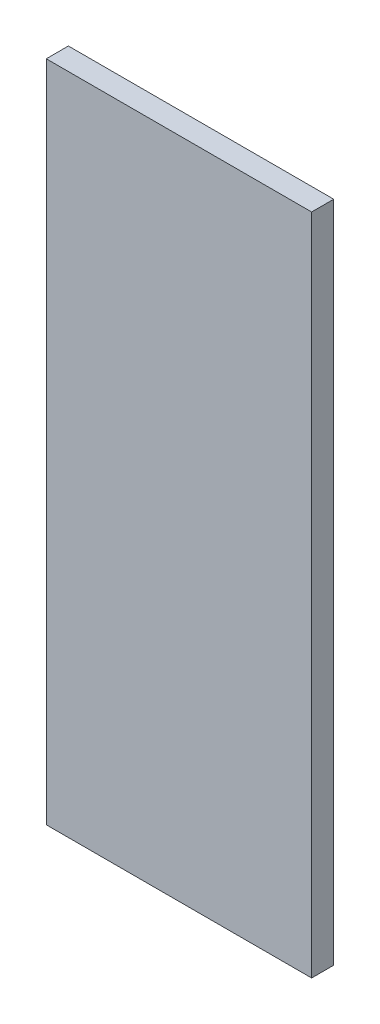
ISO-10303-21;
HEADER;
FILE_DESCRIPTION(('STEP AP214'),'2;1');
FILE_NAME('part.step','',(''),(''),'','','');
FILE_SCHEMA(('AUTOMOTIVE_DESIGN { 1 0 10303 214 1 1 1 1 }'));
ENDSEC;
DATA;
#1=APPLICATION_CONTEXT('core data for automotive mechanical design processes');
#2=APPLICATION_PROTOCOL_DEFINITION('international standard','automotive_design',2000,#1);
#3=PRODUCT_CONTEXT('',#1,'mechanical');
#4=PRODUCT('Part','Part','',(#3));
#5=PRODUCT_RELATED_PRODUCT_CATEGORY('part','',(#4));
#6=PRODUCT_DEFINITION_FORMATION('','',#4);
#7=PRODUCT_DEFINITION_CONTEXT('part definition',#1,'design');
#8=PRODUCT_DEFINITION('design','',#6,#7);
#9=PRODUCT_DEFINITION_SHAPE('','',#8);
#10=(LENGTH_UNIT() NAMED_UNIT(*) SI_UNIT(.MILLI.,.METRE.));
#11=(NAMED_UNIT(*) PLANE_ANGLE_UNIT() SI_UNIT($,.RADIAN.));
#12=(NAMED_UNIT(*) SI_UNIT($,.STERADIAN.) SOLID_ANGLE_UNIT());
#13=UNCERTAINTY_MEASURE_WITH_UNIT(LENGTH_MEASURE(1.E-05),#10,'distance_accuracy_value','');
#14=(GEOMETRIC_REPRESENTATION_CONTEXT(3) GLOBAL_UNCERTAINTY_ASSIGNED_CONTEXT((#13)) GLOBAL_UNIT_ASSIGNED_CONTEXT((#10,
#11,#12)) REPRESENTATION_CONTEXT('',''));
#15=CARTESIAN_POINT('',(0.,0.,0.));
#16=DIRECTION('',(0.,0.,1.));
#17=DIRECTION('',(1.,0.,0.));
#18=AXIS2_PLACEMENT_3D('',#15,#16,#17);
#19=CARTESIAN_POINT('',(-6.,15.,1.));
#20=DIRECTION('',(1.,0.,0.));
#21=DIRECTION('',(0.,1.,0.));
#22=AXIS2_PLACEMENT_3D('',#19,#20,#21);
#23=PLANE('',#22);
#24=DIRECTION('',(0.,-1.,0.));
#25=VECTOR('',#24,1.);
#26=CARTESIAN_POINT('',(-6.,15.,0.));
#27=LINE('',#26,#25);
#28=CARTESIAN_POINT('',(-6.,15.,0.));
#29=VERTEX_POINT('',#28);
#30=CARTESIAN_POINT('',(-6.,-15.,0.));
#31=VERTEX_POINT('',#30);
#32=EDGE_CURVE('E96',#29,#31,#27,.T.);
#33=ORIENTED_EDGE('',*,*,#32,.T.);
#34=DIRECTION('',(0.,0.,-1.));
#35=VECTOR('',#34,1.);
#36=CARTESIAN_POINT('',(-6.,-15.,1.));
#37=LINE('',#36,#35);
#38=CARTESIAN_POINT('',(-6.,-15.,1.));
#39=VERTEX_POINT('',#38);
#40=EDGE_CURVE('E11',#39,#31,#37,.T.);
#41=ORIENTED_EDGE('',*,*,#40,.F.);
#42=DIRECTION('',(0.,-1.,0.));
#43=VECTOR('',#42,1.);
#44=CARTESIAN_POINT('',(-6.,15.,1.));
#45=LINE('',#44,#43);
#46=CARTESIAN_POINT('',(-6.,15.,1.));
#47=VERTEX_POINT('',#46);
#48=EDGE_CURVE('E84',#47,#39,#45,.T.);
#49=ORIENTED_EDGE('',*,*,#48,.F.);
#50=DIRECTION('',(0.,0.,-1.));
#51=VECTOR('',#50,1.);
#52=CARTESIAN_POINT('',(-6.,15.,1.));
#53=LINE('',#52,#51);
#54=EDGE_CURVE('E92',#47,#29,#53,.T.);
#55=ORIENTED_EDGE('',*,*,#54,.T.);
#56=EDGE_LOOP('',(#33,#41,#49,#55));
#57=FACE_BOUND('',#56,.T.);
#58=ADVANCED_FACE('F33',(#57),#23,.F.);
#59=CARTESIAN_POINT('',(-6.,-15.,1.));
#60=DIRECTION('',(0.,1.,0.));
#61=DIRECTION('',(0.,0.,1.));
#62=AXIS2_PLACEMENT_3D('',#59,#60,#61);
#63=PLANE('',#62);
#64=DIRECTION('',(1.,0.,0.));
#65=VECTOR('',#64,1.);
#66=CARTESIAN_POINT('',(-6.,-15.,0.));
#67=LINE('',#66,#65);
#68=CARTESIAN_POINT('',(6.,-15.,0.));
#69=VERTEX_POINT('',#68);
#70=EDGE_CURVE('E88',#31,#69,#67,.T.);
#71=ORIENTED_EDGE('',*,*,#70,.T.);
#72=DIRECTION('',(0.,0.,-1.));
#73=VECTOR('',#72,1.);
#74=CARTESIAN_POINT('',(6.,-15.,1.));
#75=LINE('',#74,#73);
#76=CARTESIAN_POINT('',(6.,-15.,1.));
#77=VERTEX_POINT('',#76);
#78=EDGE_CURVE('E41',#77,#69,#75,.T.);
#79=ORIENTED_EDGE('',*,*,#78,.F.);
#80=DIRECTION('',(1.,0.,0.));
#81=VECTOR('',#80,1.);
#82=CARTESIAN_POINT('',(-6.,-15.,1.));
#83=LINE('',#82,#81);
#84=EDGE_CURVE('E79',#39,#77,#83,.T.);
#85=ORIENTED_EDGE('',*,*,#84,.F.);
#86=ORIENTED_EDGE('',*,*,#40,.T.);
#87=EDGE_LOOP('',(#71,#79,#85,#86));
#88=FACE_BOUND('',#87,.T.);
#89=ADVANCED_FACE('F87',(#88),#63,.F.);
#90=CARTESIAN_POINT('',(6.,15.,1.));
#91=DIRECTION('',(-1.,0.,0.));
#92=DIRECTION('',(0.,0.,1.));
#93=AXIS2_PLACEMENT_3D('',#90,#91,#92);
#94=PLANE('',#93);
#95=DIRECTION('',(0.,1.,0.));
#96=VECTOR('',#95,1.);
#97=CARTESIAN_POINT('',(6.,15.,0.));
#98=LINE('',#97,#96);
#99=CARTESIAN_POINT('',(6.,15.,0.));
#100=VERTEX_POINT('',#99);
#101=EDGE_CURVE('E66',#69,#100,#98,.T.);
#102=ORIENTED_EDGE('',*,*,#101,.T.);
#103=DIRECTION('',(0.,0.,-1.));
#104=VECTOR('',#103,1.);
#105=CARTESIAN_POINT('',(6.,15.,1.));
#106=LINE('',#105,#104);
#107=CARTESIAN_POINT('',(6.,15.,1.));
#108=VERTEX_POINT('',#107);
#109=EDGE_CURVE('E89',#108,#100,#106,.T.);
#110=ORIENTED_EDGE('',*,*,#109,.F.);
#111=DIRECTION('',(0.,1.,0.));
#112=VECTOR('',#111,1.);
#113=CARTESIAN_POINT('',(6.,15.,1.));
#114=LINE('',#113,#112);
#115=EDGE_CURVE('E82',#77,#108,#114,.T.);
#116=ORIENTED_EDGE('',*,*,#115,.F.);
#117=ORIENTED_EDGE('',*,*,#78,.T.);
#118=EDGE_LOOP('',(#102,#110,#116,#117));
#119=FACE_BOUND('',#118,.T.);
#120=ADVANCED_FACE('F90',(#119),#94,.F.);
#121=CARTESIAN_POINT('',(-6.,15.,1.));
#122=DIRECTION('',(0.,-1.,0.));
#123=DIRECTION('',(0.,0.,-1.));
#124=AXIS2_PLACEMENT_3D('',#121,#122,#123);
#125=PLANE('',#124);
#126=DIRECTION('',(-1.,0.,0.));
#127=VECTOR('',#126,1.);
#128=CARTESIAN_POINT('',(-6.,15.,0.));
#129=LINE('',#128,#127);
#130=EDGE_CURVE('E72',#100,#29,#129,.T.);
#131=ORIENTED_EDGE('',*,*,#130,.T.);
#132=ORIENTED_EDGE('',*,*,#54,.F.);
#133=DIRECTION('',(-1.,0.,0.));
#134=VECTOR('',#133,1.);
#135=CARTESIAN_POINT('',(-6.,15.,1.));
#136=LINE('',#135,#134);
#137=EDGE_CURVE('E49',#108,#47,#136,.T.);
#138=ORIENTED_EDGE('',*,*,#137,.F.);
#139=ORIENTED_EDGE('',*,*,#109,.T.);
#140=EDGE_LOOP('',(#131,#132,#138,#139));
#141=FACE_BOUND('',#140,.T.);
#142=ADVANCED_FACE('F103',(#141),#125,.F.);
#143=CARTESIAN_POINT('',(0.,0.,1.));
#144=DIRECTION('',(0.,0.,1.));
#145=DIRECTION('',(1.,0.,0.));
#146=AXIS2_PLACEMENT_3D('',#143,#144,#145);
#147=PLANE('',#146);
#148=ORIENTED_EDGE('',*,*,#48,.T.);
#149=ORIENTED_EDGE('',*,*,#84,.T.);
#150=ORIENTED_EDGE('',*,*,#115,.T.);
#151=ORIENTED_EDGE('',*,*,#137,.T.);
#152=EDGE_LOOP('',(#148,#149,#150,#151));
#153=FACE_BOUND('',#152,.T.);
#154=ADVANCED_FACE('F80',(#153),#147,.T.);
#155=CARTESIAN_POINT('',(0.,0.,0.));
#156=DIRECTION('',(0.,0.,1.));
#157=DIRECTION('',(1.,0.,0.));
#158=AXIS2_PLACEMENT_3D('',#155,#156,#157);
#159=PLANE('',#158);
#160=ORIENTED_EDGE('',*,*,#32,.F.);
#161=ORIENTED_EDGE('',*,*,#130,.F.);
#162=ORIENTED_EDGE('',*,*,#101,.F.);
#163=ORIENTED_EDGE('',*,*,#70,.F.);
#164=EDGE_LOOP('',(#160,#161,#162,#163));
#165=FACE_BOUND('',#164,.T.);
#166=ADVANCED_FACE('F106',(#165),#159,.F.);
#167=CLOSED_SHELL('',(#58,#89,#120,#142,#154,#166));
#168=MANIFOLD_SOLID_BREP('B2',#167);
#169=ADVANCED_BREP_SHAPE_REPRESENTATION('',(#18,#168),#14);
#170=SHAPE_DEFINITION_REPRESENTATION(#9,#169);
ENDSEC;
END-ISO-10303-21;
